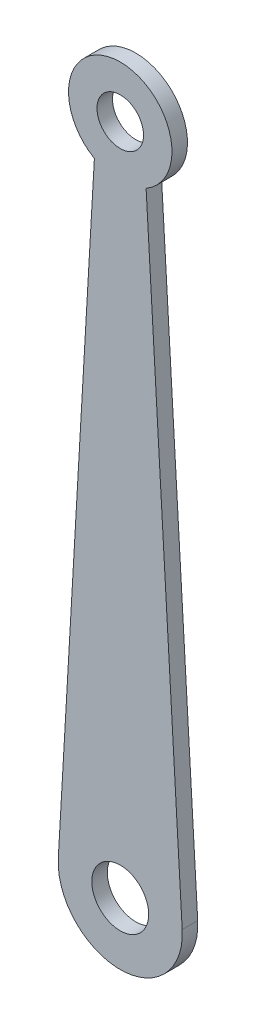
from build123d import *

# Parameters (mm, degrees)
SKETCH1_R      = 2.25
SKETCH1_R_2    = 2.75
EXTRUDE1_DEPTH = 1.5


with BuildPart() as part:
    # Sketch1 → Extrude1 (new body)
    with BuildSketch(Plane.XY):
        with BuildLine():
            Line((-2.500012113, 60.669873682), (-5.989983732, 0.346547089))
            ThreePointArc((-5.989983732, 0.346547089), (0, -6), (5.989983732, 0.346547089))
            Line((5.989983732, 0.346547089), (2.500012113, 60.669873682))
            ThreePointArc((2.500012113, 60.669873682), (0, 70.000006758), (-2.500012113, 60.669873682))
        make_face()
        with Locations((0, 65.000000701)):
            Circle(SKETCH1_R, mode=Mode.SUBTRACT)
        Circle(SKETCH1_R_2, mode=Mode.SUBTRACT)
    extrude(amount=EXTRUDE1_DEPTH)


solid = part.part
